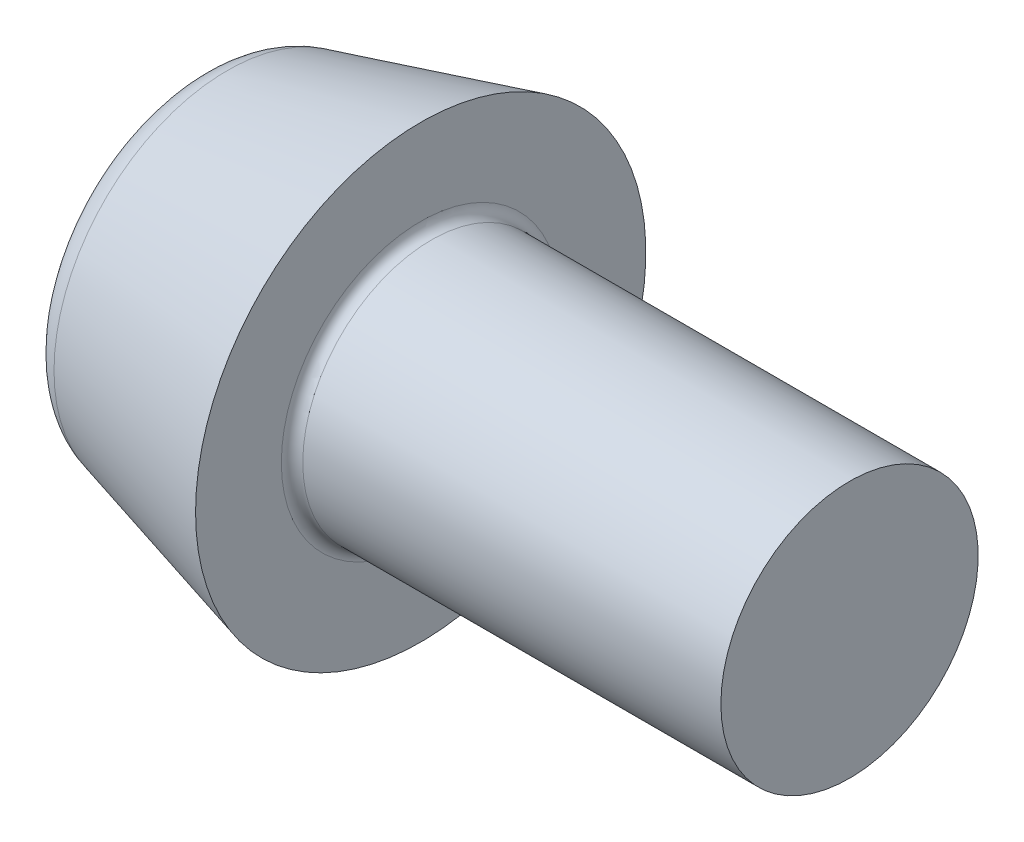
from build123d import *

# Parameters (mm, degrees)
FILLET1_R = 0.5
FILLET2_R = 2


with BuildPart() as part:
    # Sketch1 → Base-Revolve (revolve)
    with BuildSketch(Plane.XY, mode=Mode.PRIVATE) as base_revolve_sk:
        Polygon((0, 0), (30.5, 0), (30.5, 6), (10.5, 6), (10.5, 10.5), (0, 7.686533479), align=None)
    revolve(base_revolve_sk.sketch.rotate(Axis((-26.488571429, 0, 0), (1, 0, 0)), 90), axis=Axis((-26.488571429, 0, 0), (1, 0, 0)))

    # Fillet1
    fillet1_edges = [part.edges().sort_by_distance(p)[0] for p in [
        (10.5, 0, -6),
    ]]
    fillet(fillet1_edges, radius=FILLET1_R)

    # Fillet2
    fillet2_edges = [part.edges().sort_by_distance(p)[0] for p in [
        (0, 0, -7.686533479),
    ]]
    fillet(fillet2_edges, radius=FILLET2_R)


solid = part.part
